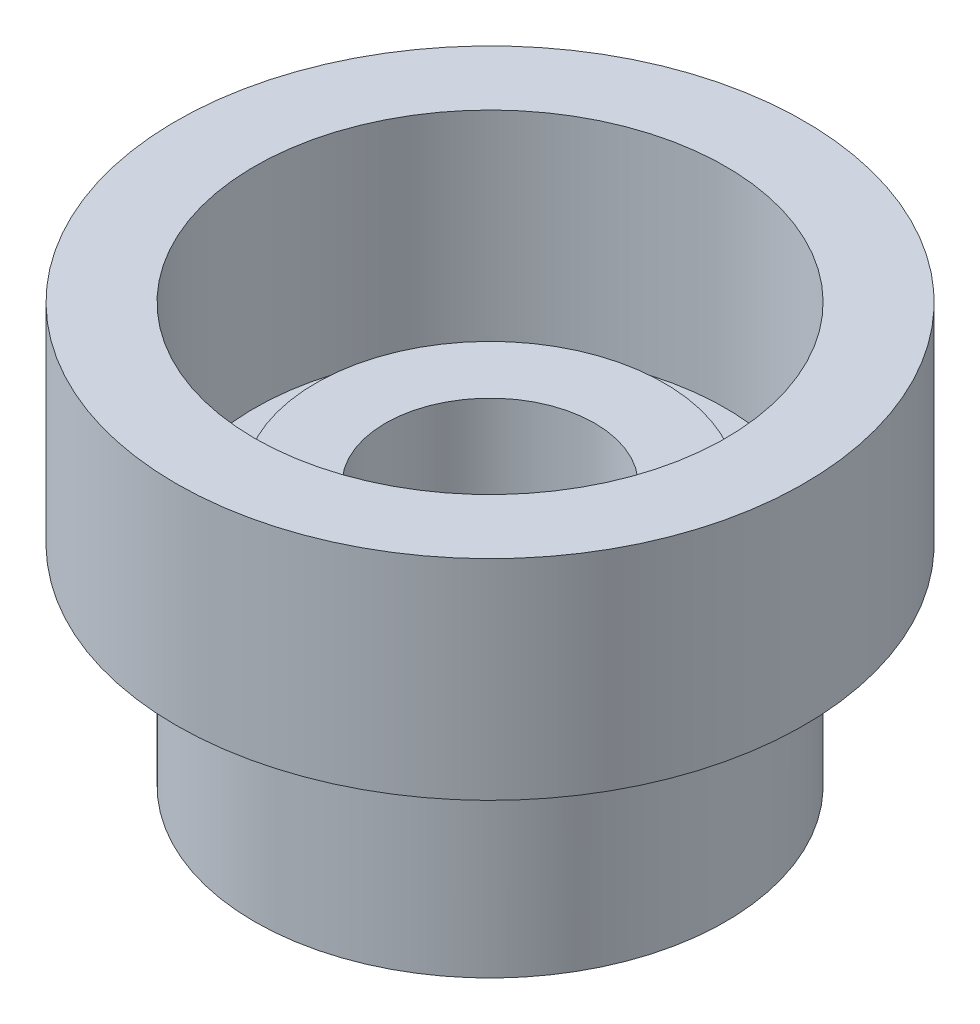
ISO-10303-21;
HEADER;
FILE_DESCRIPTION(('STEP AP214'),'2;1');
FILE_NAME('part.step','',(''),(''),'','','');
FILE_SCHEMA(('AUTOMOTIVE_DESIGN { 1 0 10303 214 1 1 1 1 }'));
ENDSEC;
DATA;
#1=APPLICATION_CONTEXT('core data for automotive mechanical design processes');
#2=APPLICATION_PROTOCOL_DEFINITION('international standard','automotive_design',2000,#1);
#3=PRODUCT_CONTEXT('',#1,'mechanical');
#4=PRODUCT('Part','Part','',(#3));
#5=PRODUCT_RELATED_PRODUCT_CATEGORY('part','',(#4));
#6=PRODUCT_DEFINITION_FORMATION('','',#4);
#7=PRODUCT_DEFINITION_CONTEXT('part definition',#1,'design');
#8=PRODUCT_DEFINITION('design','',#6,#7);
#9=PRODUCT_DEFINITION_SHAPE('','',#8);
#10=(LENGTH_UNIT() NAMED_UNIT(*) SI_UNIT(.MILLI.,.METRE.));
#11=(NAMED_UNIT(*) PLANE_ANGLE_UNIT() SI_UNIT($,.RADIAN.));
#12=(NAMED_UNIT(*) SI_UNIT($,.STERADIAN.) SOLID_ANGLE_UNIT());
#13=UNCERTAINTY_MEASURE_WITH_UNIT(LENGTH_MEASURE(1.E-05),#10,'distance_accuracy_value','');
#14=(GEOMETRIC_REPRESENTATION_CONTEXT(3) GLOBAL_UNCERTAINTY_ASSIGNED_CONTEXT((#13)) GLOBAL_UNIT_ASSIGNED_CONTEXT((#10,
#11,#12)) REPRESENTATION_CONTEXT('',''));
#15=CARTESIAN_POINT('',(0.,0.,0.));
#16=DIRECTION('',(0.,0.,1.));
#17=DIRECTION('',(1.,0.,0.));
#18=AXIS2_PLACEMENT_3D('',#15,#16,#17);
#19=CARTESIAN_POINT('',(0.,0.,0.));
#20=DIRECTION('',(0.,1.,0.));
#21=DIRECTION('',(0.,0.,1.));
#22=AXIS2_PLACEMENT_3D('',#19,#20,#21);
#23=PLANE('',#22);
#24=CARTESIAN_POINT('',(0.,0.,0.));
#25=DIRECTION('',(0.,1.,0.));
#26=DIRECTION('',(0.,0.,1.));
#27=AXIS2_PLACEMENT_3D('',#24,#25,#26);
#28=CIRCLE('',#27,152.4);
#29=CARTESIAN_POINT('',(0.,0.,152.4));
#30=VERTEX_POINT('',#29);
#31=EDGE_CURVE('E49',#30,#30,#28,.T.);
#32=ORIENTED_EDGE('',*,*,#31,.F.);
#33=EDGE_LOOP('',(#32));
#34=FACE_BOUND('',#33,.T.);
#35=CARTESIAN_POINT('',(0.,0.,0.));
#36=DIRECTION('',(0.,1.,0.));
#37=DIRECTION('',(0.,0.,1.));
#38=AXIS2_PLACEMENT_3D('',#35,#36,#37);
#39=CIRCLE('',#38,114.3);
#40=CARTESIAN_POINT('',(0.,0.,114.3));
#41=VERTEX_POINT('',#40);
#42=EDGE_CURVE('E41',#41,#41,#39,.T.);
#43=ORIENTED_EDGE('',*,*,#42,.T.);
#44=EDGE_LOOP('',(#43));
#45=FACE_BOUND('',#44,.T.);
#46=ADVANCED_FACE('F37',(#34,#45),#23,.F.);
#47=CARTESIAN_POINT('',(0.,101.6,0.));
#48=DIRECTION('',(0.,-1.,0.));
#49=DIRECTION('',(0.,0.,-1.));
#50=AXIS2_PLACEMENT_3D('',#47,#48,#49);
#51=CYLINDRICAL_SURFACE('',#50,152.4);
#52=CARTESIAN_POINT('',(0.,101.6,0.));
#53=DIRECTION('',(0.,1.,0.));
#54=DIRECTION('',(0.,0.,1.));
#55=AXIS2_PLACEMENT_3D('',#52,#53,#54);
#56=CIRCLE('',#55,152.4);
#57=CARTESIAN_POINT('',(0.,101.6,152.4));
#58=VERTEX_POINT('',#57);
#59=EDGE_CURVE('E45',#58,#58,#56,.T.);
#60=ORIENTED_EDGE('',*,*,#59,.F.);
#61=EDGE_LOOP('',(#60));
#62=FACE_BOUND('',#61,.T.);
#63=ORIENTED_EDGE('',*,*,#31,.T.);
#64=EDGE_LOOP('',(#63));
#65=FACE_BOUND('',#64,.T.);
#66=ADVANCED_FACE('F64',(#62,#65),#51,.T.);
#67=CARTESIAN_POINT('',(0.,101.6,0.));
#68=DIRECTION('',(0.,1.,0.));
#69=DIRECTION('',(0.,0.,1.));
#70=AXIS2_PLACEMENT_3D('',#67,#68,#69);
#71=PLANE('',#70);
#72=CARTESIAN_POINT('',(0.,101.6,0.));
#73=DIRECTION('',(0.,1.,0.));
#74=DIRECTION('',(0.,0.,1.));
#75=AXIS2_PLACEMENT_3D('',#72,#73,#74);
#76=CIRCLE('',#75,114.3);
#77=CARTESIAN_POINT('',(0.,101.6,114.3));
#78=VERTEX_POINT('',#77);
#79=EDGE_CURVE('E11',#78,#78,#76,.T.);
#80=ORIENTED_EDGE('',*,*,#79,.F.);
#81=EDGE_LOOP('',(#80));
#82=FACE_BOUND('',#81,.T.);
#83=ORIENTED_EDGE('',*,*,#59,.T.);
#84=EDGE_LOOP('',(#83));
#85=FACE_BOUND('',#84,.T.);
#86=ADVANCED_FACE('F60',(#82,#85),#71,.T.);
#87=CARTESIAN_POINT('',(0.,0.,0.));
#88=DIRECTION('',(0.,1.,0.));
#89=DIRECTION('',(0.,0.,1.));
#90=AXIS2_PLACEMENT_3D('',#87,#88,#89);
#91=CYLINDRICAL_SURFACE('',#90,114.3);
#92=ORIENTED_EDGE('',*,*,#42,.F.);
#93=EDGE_LOOP('',(#92));
#94=FACE_BOUND('',#93,.T.);
#95=ORIENTED_EDGE('',*,*,#79,.T.);
#96=EDGE_LOOP('',(#95));
#97=FACE_BOUND('',#96,.T.);
#98=ADVANCED_FACE('F39',(#94,#97),#91,.F.);
#99=CLOSED_SHELL('',(#46,#66,#86,#98));
#100=MANIFOLD_SOLID_BREP('B2',#99);
#101=CARTESIAN_POINT('',(0.,0.,0.));
#102=DIRECTION('',(0.,1.,0.));
#103=DIRECTION('',(0.,0.,1.));
#104=AXIS2_PLACEMENT_3D('',#101,#102,#103);
#105=PLANE('',#104);
#106=CARTESIAN_POINT('',(0.,0.,0.));
#107=DIRECTION('',(0.,1.,0.));
#108=DIRECTION('',(0.,0.,1.));
#109=AXIS2_PLACEMENT_3D('',#106,#107,#108);
#110=CIRCLE('',#109,114.3);
#111=CARTESIAN_POINT('',(0.,0.,114.3));
#112=VERTEX_POINT('',#111);
#113=EDGE_CURVE('E110',#112,#112,#110,.T.);
#114=ORIENTED_EDGE('',*,*,#113,.T.);
#115=EDGE_LOOP('',(#114));
#116=FACE_BOUND('',#115,.T.);
#117=CARTESIAN_POINT('',(0.,0.,0.));
#118=DIRECTION('',(0.,1.,0.));
#119=DIRECTION('',(0.,0.,1.));
#120=AXIS2_PLACEMENT_3D('',#117,#118,#119);
#121=CIRCLE('',#120,84.5356216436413);
#122=CARTESIAN_POINT('',(0.,0.,84.5356216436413));
#123=VERTEX_POINT('',#122);
#124=EDGE_CURVE('E119',#123,#123,#121,.T.);
#125=ORIENTED_EDGE('',*,*,#124,.F.);
#126=EDGE_LOOP('',(#125));
#127=FACE_BOUND('',#126,.T.);
#128=ADVANCED_FACE('F99',(#116,#127),#105,.T.);
#129=CARTESIAN_POINT('',(0.,-101.6,0.));
#130=DIRECTION('',(0.,1.,0.));
#131=DIRECTION('',(0.,0.,1.));
#132=AXIS2_PLACEMENT_3D('',#129,#130,#131);
#133=CYLINDRICAL_SURFACE('',#132,114.3);
#134=CARTESIAN_POINT('',(0.,-101.6,0.));
#135=DIRECTION('',(0.,-1.,0.));
#136=DIRECTION('',(0.,0.,-1.));
#137=AXIS2_PLACEMENT_3D('',#134,#135,#136);
#138=CIRCLE('',#137,114.3);
#139=CARTESIAN_POINT('',(0.,-101.6,-114.3));
#140=VERTEX_POINT('',#139);
#141=EDGE_CURVE('E36',#140,#140,#138,.T.);
#142=ORIENTED_EDGE('',*,*,#141,.F.);
#143=EDGE_LOOP('',(#142));
#144=FACE_BOUND('',#143,.T.);
#145=ORIENTED_EDGE('',*,*,#113,.F.);
#146=EDGE_LOOP('',(#145));
#147=FACE_BOUND('',#146,.T.);
#148=ADVANCED_FACE('F101',(#144,#147),#133,.T.);
#149=CARTESIAN_POINT('',(0.,-101.6,0.));
#150=DIRECTION('',(0.,-1.,0.));
#151=DIRECTION('',(0.,0.,-1.));
#152=AXIS2_PLACEMENT_3D('',#149,#150,#151);
#153=PLANE('',#152);
#154=CARTESIAN_POINT('',(0.,-101.6,0.));
#155=DIRECTION('',(0.,-1.,0.));
#156=DIRECTION('',(0.,0.,-1.));
#157=AXIS2_PLACEMENT_3D('',#154,#155,#156);
#158=CIRCLE('',#157,50.8);
#159=CARTESIAN_POINT('',(0.,-101.6,-50.8));
#160=VERTEX_POINT('',#159);
#161=EDGE_CURVE('E106',#160,#160,#158,.T.);
#162=ORIENTED_EDGE('',*,*,#161,.F.);
#163=EDGE_LOOP('',(#162));
#164=FACE_BOUND('',#163,.T.);
#165=ORIENTED_EDGE('',*,*,#141,.T.);
#166=EDGE_LOOP('',(#165));
#167=FACE_BOUND('',#166,.T.);
#168=ADVANCED_FACE('F139',(#164,#167),#153,.T.);
#169=CARTESIAN_POINT('',(0.,101.6,0.));
#170=DIRECTION('',(0.,-1.,0.));
#171=DIRECTION('',(0.,0.,-1.));
#172=AXIS2_PLACEMENT_3D('',#169,#170,#171);
#173=CYLINDRICAL_SURFACE('',#172,50.8);
#174=ORIENTED_EDGE('',*,*,#161,.T.);
#175=EDGE_LOOP('',(#174));
#176=FACE_BOUND('',#175,.T.);
#177=CARTESIAN_POINT('',(0.,25.4,0.));
#178=DIRECTION('',(0.,1.,0.));
#179=DIRECTION('',(0.,0.,1.));
#180=AXIS2_PLACEMENT_3D('',#177,#178,#179);
#181=CIRCLE('',#180,50.8);
#182=CARTESIAN_POINT('',(0.,25.4,50.8));
#183=VERTEX_POINT('',#182);
#184=EDGE_CURVE('E122',#183,#183,#181,.T.);
#185=ORIENTED_EDGE('',*,*,#184,.T.);
#186=EDGE_LOOP('',(#185));
#187=FACE_BOUND('',#186,.T.);
#188=ADVANCED_FACE('F126',(#176,#187),#173,.F.);
#189=CARTESIAN_POINT('',(0.,25.4,0.));
#190=DIRECTION('',(0.,1.,0.));
#191=DIRECTION('',(0.,0.,1.));
#192=AXIS2_PLACEMENT_3D('',#189,#190,#191);
#193=PLANE('',#192);
#194=CARTESIAN_POINT('',(0.,25.4,0.));
#195=DIRECTION('',(0.,1.,0.));
#196=DIRECTION('',(0.,0.,1.));
#197=AXIS2_PLACEMENT_3D('',#194,#195,#196);
#198=CIRCLE('',#197,84.5356216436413);
#199=CARTESIAN_POINT('',(0.,25.4,84.5356216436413));
#200=VERTEX_POINT('',#199);
#201=EDGE_CURVE('E114',#200,#200,#198,.T.);
#202=ORIENTED_EDGE('',*,*,#201,.T.);
#203=EDGE_LOOP('',(#202));
#204=FACE_BOUND('',#203,.T.);
#205=ORIENTED_EDGE('',*,*,#184,.F.);
#206=EDGE_LOOP('',(#205));
#207=FACE_BOUND('',#206,.T.);
#208=ADVANCED_FACE('F128',(#204,#207),#193,.T.);
#209=CARTESIAN_POINT('',(0.,25.4,0.));
#210=DIRECTION('',(0.,-1.,0.));
#211=DIRECTION('',(0.,0.,-1.));
#212=AXIS2_PLACEMENT_3D('',#209,#210,#211);
#213=CYLINDRICAL_SURFACE('',#212,84.5356216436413);
#214=ORIENTED_EDGE('',*,*,#201,.F.);
#215=EDGE_LOOP('',(#214));
#216=FACE_BOUND('',#215,.T.);
#217=ORIENTED_EDGE('',*,*,#124,.T.);
#218=EDGE_LOOP('',(#217));
#219=FACE_BOUND('',#218,.T.);
#220=ADVANCED_FACE('F130',(#216,#219),#213,.T.);
#221=CLOSED_SHELL('',(#128,#148,#168,#188,#208,#220));
#222=MANIFOLD_SOLID_BREP('B6',#221);
#223=ADVANCED_BREP_SHAPE_REPRESENTATION('',(#18,#100,#222),#14);
#224=SHAPE_DEFINITION_REPRESENTATION(#9,#223);
ENDSEC;
END-ISO-10303-21;
